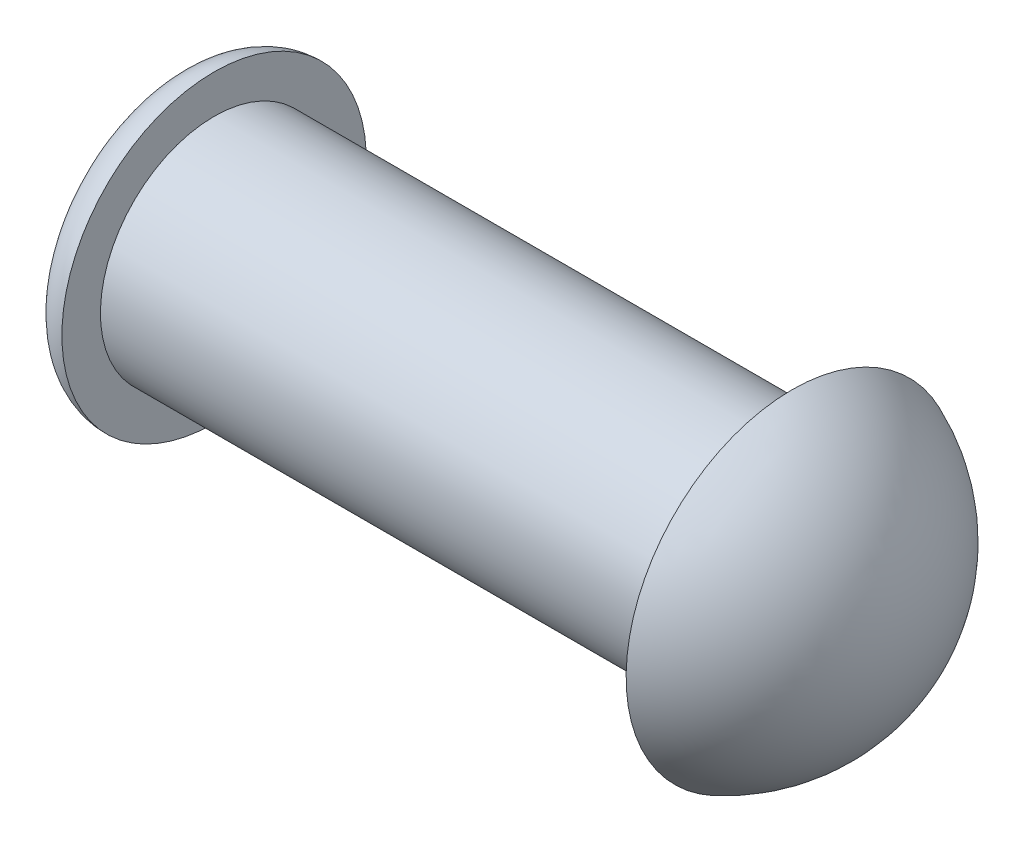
ISO-10303-21;
HEADER;
FILE_DESCRIPTION(('STEP AP214'),'2;1');
FILE_NAME('part.step','',(''),(''),'','','');
FILE_SCHEMA(('AUTOMOTIVE_DESIGN { 1 0 10303 214 1 1 1 1 }'));
ENDSEC;
DATA;
#1=APPLICATION_CONTEXT('core data for automotive mechanical design processes');
#2=APPLICATION_PROTOCOL_DEFINITION('international standard','automotive_design',2000,#1);
#3=PRODUCT_CONTEXT('',#1,'mechanical');
#4=PRODUCT('Part','Part','',(#3));
#5=PRODUCT_RELATED_PRODUCT_CATEGORY('part','',(#4));
#6=PRODUCT_DEFINITION_FORMATION('','',#4);
#7=PRODUCT_DEFINITION_CONTEXT('part definition',#1,'design');
#8=PRODUCT_DEFINITION('design','',#6,#7);
#9=PRODUCT_DEFINITION_SHAPE('','',#8);
#10=(LENGTH_UNIT() NAMED_UNIT(*) SI_UNIT(.MILLI.,.METRE.));
#11=(NAMED_UNIT(*) PLANE_ANGLE_UNIT() SI_UNIT($,.RADIAN.));
#12=(NAMED_UNIT(*) SI_UNIT($,.STERADIAN.) SOLID_ANGLE_UNIT());
#13=UNCERTAINTY_MEASURE_WITH_UNIT(LENGTH_MEASURE(1.E-05),#10,'distance_accuracy_value','');
#14=(GEOMETRIC_REPRESENTATION_CONTEXT(3) GLOBAL_UNCERTAINTY_ASSIGNED_CONTEXT((#13)) GLOBAL_UNIT_ASSIGNED_CONTEXT((#10,
#11,#12)) REPRESENTATION_CONTEXT('',''));
#15=CARTESIAN_POINT('',(0.,0.,0.));
#16=DIRECTION('',(0.,0.,1.));
#17=DIRECTION('',(1.,0.,0.));
#18=AXIS2_PLACEMENT_3D('',#15,#16,#17);
#19=CARTESIAN_POINT('',(1.27,8.25500000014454,-7.75970000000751));
#20=DIRECTION('',(1.,0.,0.));
#21=DIRECTION('',(0.,1.,0.));
#22=AXIS2_PLACEMENT_3D('',#19,#20,#21);
#23=PLANE('',#22);
#24=CARTESIAN_POINT('',(1.27,8.25500000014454,-7.75970000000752));
#25=DIRECTION('',(1.,0.,0.));
#26=DIRECTION('',(0.,1.,0.));
#27=AXIS2_PLACEMENT_3D('',#24,#25,#26);
#28=CIRCLE('',#27,0.990599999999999);
#29=CARTESIAN_POINT('',(1.27,9.24560000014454,-7.75970000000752));
#30=VERTEX_POINT('',#29);
#31=EDGE_CURVE('E19',#30,#30,#28,.F.);
#32=ORIENTED_EDGE('',*,*,#31,.T.);
#33=EDGE_LOOP('',(#32));
#34=FACE_BOUND('',#33,.T.);
#35=ADVANCED_FACE('F15',(#34),#23,.F.);
#36=CARTESIAN_POINT('',(-1.27,8.25500000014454,-7.75970000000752));
#37=DIRECTION('',(1.,0.,0.));
#38=DIRECTION('',(0.,1.,0.));
#39=AXIS2_PLACEMENT_3D('',#36,#37,#38);
#40=CYLINDRICAL_SURFACE('',#39,0.990599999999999);
#41=ORIENTED_EDGE('',*,*,#31,.F.);
#42=EDGE_LOOP('',(#41));
#43=FACE_BOUND('',#42,.T.);
#44=CARTESIAN_POINT('',(-3.81,8.25500000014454,-7.75970000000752));
#45=DIRECTION('',(1.,0.,0.));
#46=DIRECTION('',(0.,1.,0.));
#47=AXIS2_PLACEMENT_3D('',#44,#45,#46);
#48=CIRCLE('',#47,0.990599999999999);
#49=CARTESIAN_POINT('',(-3.81,9.24560000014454,-7.75970000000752));
#50=VERTEX_POINT('',#49);
#51=EDGE_CURVE('E31',#50,#50,#48,.T.);
#52=ORIENTED_EDGE('',*,*,#51,.F.);
#53=EDGE_LOOP('',(#52));
#54=FACE_BOUND('',#53,.T.);
#55=ADVANCED_FACE('F45',(#43,#54),#40,.F.);
#56=CARTESIAN_POINT('',(-3.81,8.25500000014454,-7.75970000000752));
#57=DIRECTION('',(1.,0.,0.));
#58=DIRECTION('',(0.,1.,0.));
#59=AXIS2_PLACEMENT_3D('',#56,#57,#58);
#60=TOROIDAL_SURFACE('',#59,1.4986,0.508);
#61=ORIENTED_EDGE('',*,*,#51,.T.);
#62=EDGE_LOOP('',(#61));
#63=FACE_BOUND('',#62,.T.);
#64=CARTESIAN_POINT('',(-3.81,8.25500000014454,-7.75970000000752));
#65=DIRECTION('',(1.,0.,0.));
#66=DIRECTION('',(0.,1.,0.));
#67=AXIS2_PLACEMENT_3D('',#64,#65,#66);
#68=CIRCLE('',#67,2.0066);
#69=CARTESIAN_POINT('',(-3.81,10.2616000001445,-7.75970000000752));
#70=VERTEX_POINT('',#69);
#71=EDGE_CURVE('E34',#70,#70,#68,.F.);
#72=ORIENTED_EDGE('',*,*,#71,.T.);
#73=EDGE_LOOP('',(#72));
#74=FACE_BOUND('',#73,.T.);
#75=ADVANCED_FACE('F48',(#63,#74),#60,.T.);
#76=CARTESIAN_POINT('',(2.92100000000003,8.25500000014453,-7.7597000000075));
#77=DIRECTION('',(0.0353908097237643,0.653116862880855,0.756429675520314));
#78=DIRECTION('',(0.372480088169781,-0.710986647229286,0.596453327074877));
#79=AXIS2_PLACEMENT_3D('',#76,#77,#78);
#80=SPHERICAL_SURFACE('',#79,2.36219999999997);
#81=CARTESIAN_POINT('',(2.92100000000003,8.25500000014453,-7.7597000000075));
#82=DIRECTION('',(1.,0.,0.));
#83=DIRECTION('',(0.,1.,0.));
#84=AXIS2_PLACEMENT_3D('',#81,#82,#83);
#85=SPHERICAL_SURFACE('',#84,2.36219999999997);
#86=CARTESIAN_POINT('',(3.81,8.25500000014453,-7.7597000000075));
#87=DIRECTION('',(1.,0.,0.));
#88=DIRECTION('',(0.,1.,0.));
#89=AXIS2_PLACEMENT_3D('',#86,#87,#88);
#90=CIRCLE('',#89,2.18853097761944);
#91=CARTESIAN_POINT('',(3.81,10.443530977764,-7.7597000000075));
#92=VERTEX_POINT('',#91);
#93=EDGE_CURVE('E28',#92,#92,#90,.T.);
#94=ORIENTED_EDGE('',*,*,#93,.T.);
#95=EDGE_LOOP('',(#94));
#96=FACE_BOUND('',#95,.T.);
#97=ADVANCED_FACE('F17',(#96),#85,.T.);
#98=CARTESIAN_POINT('',(-3.81,8.25500000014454,-7.75970000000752));
#99=DIRECTION('',(-1.,0.,0.));
#100=DIRECTION('',(0.,-1.,0.));
#101=AXIS2_PLACEMENT_3D('',#98,#99,#100);
#102=PLANE('',#101);
#103=ORIENTED_EDGE('',*,*,#71,.F.);
#104=EDGE_LOOP('',(#103));
#105=FACE_BOUND('',#104,.T.);
#106=CARTESIAN_POINT('',(-3.81,8.25500000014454,-7.75970000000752));
#107=DIRECTION('',(1.,0.,0.));
#108=DIRECTION('',(0.,1.,0.));
#109=AXIS2_PLACEMENT_3D('',#106,#107,#108);
#110=CIRCLE('',#109,1.4986);
#111=CARTESIAN_POINT('',(-3.81,9.75360000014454,-7.75970000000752));
#112=VERTEX_POINT('',#111);
#113=EDGE_CURVE('E23',#112,#112,#110,.T.);
#114=ORIENTED_EDGE('',*,*,#113,.F.);
#115=EDGE_LOOP('',(#114));
#116=FACE_BOUND('',#115,.T.);
#117=ADVANCED_FACE('F64',(#105,#116),#102,.F.);
#118=CARTESIAN_POINT('',(3.81,8.25500000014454,-7.75970000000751));
#119=DIRECTION('',(1.,0.,0.));
#120=DIRECTION('',(0.,1.,0.));
#121=AXIS2_PLACEMENT_3D('',#118,#119,#120);
#122=PLANE('',#121);
#123=CARTESIAN_POINT('',(3.81,8.25500000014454,-7.75970000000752));
#124=DIRECTION('',(1.,0.,0.));
#125=DIRECTION('',(0.,1.,0.));
#126=AXIS2_PLACEMENT_3D('',#123,#124,#125);
#127=CIRCLE('',#126,1.4986);
#128=CARTESIAN_POINT('',(3.81,9.75360000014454,-7.75970000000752));
#129=VERTEX_POINT('',#128);
#130=EDGE_CURVE('E10',#129,#129,#127,.F.);
#131=ORIENTED_EDGE('',*,*,#130,.F.);
#132=EDGE_LOOP('',(#131));
#133=FACE_BOUND('',#132,.T.);
#134=ORIENTED_EDGE('',*,*,#93,.F.);
#135=EDGE_LOOP('',(#134));
#136=FACE_BOUND('',#135,.T.);
#137=ADVANCED_FACE('F59',(#133,#136),#122,.F.);
#138=CARTESIAN_POINT('',(0.,8.25500000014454,-7.75970000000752));
#139=DIRECTION('',(1.,0.,0.));
#140=DIRECTION('',(0.,1.,0.));
#141=AXIS2_PLACEMENT_3D('',#138,#139,#140);
#142=CYLINDRICAL_SURFACE('',#141,1.4986);
#143=ORIENTED_EDGE('',*,*,#130,.T.);
#144=EDGE_LOOP('',(#143));
#145=FACE_BOUND('',#144,.T.);
#146=ORIENTED_EDGE('',*,*,#113,.T.);
#147=EDGE_LOOP('',(#146));
#148=FACE_BOUND('',#147,.T.);
#149=ADVANCED_FACE('F57',(#145,#148),#142,.T.);
#150=CLOSED_SHELL('',(#35,#55,#75,#97,#117,#137,#149));
#151=MANIFOLD_SOLID_BREP('B1',#150);
#152=ADVANCED_BREP_SHAPE_REPRESENTATION('',(#18,#151),#14);
#153=SHAPE_DEFINITION_REPRESENTATION(#9,#152);
ENDSEC;
END-ISO-10303-21;
